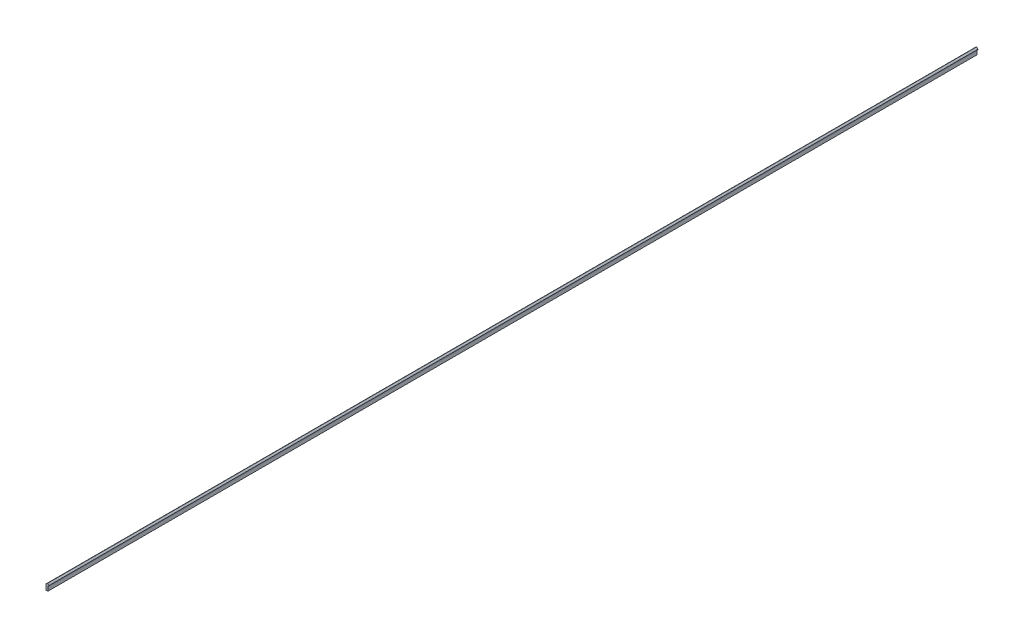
ISO-10303-21;
HEADER;
FILE_DESCRIPTION(('STEP AP214'),'2;1');
FILE_NAME('part.step','',(''),(''),'','','');
FILE_SCHEMA(('AUTOMOTIVE_DESIGN { 1 0 10303 214 1 1 1 1 }'));
ENDSEC;
DATA;
#1=APPLICATION_CONTEXT('core data for automotive mechanical design processes');
#2=APPLICATION_PROTOCOL_DEFINITION('international standard','automotive_design',2000,#1);
#3=PRODUCT_CONTEXT('',#1,'mechanical');
#4=PRODUCT('Part','Part','',(#3));
#5=PRODUCT_RELATED_PRODUCT_CATEGORY('part','',(#4));
#6=PRODUCT_DEFINITION_FORMATION('','',#4);
#7=PRODUCT_DEFINITION_CONTEXT('part definition',#1,'design');
#8=PRODUCT_DEFINITION('design','',#6,#7);
#9=PRODUCT_DEFINITION_SHAPE('','',#8);
#10=(LENGTH_UNIT() NAMED_UNIT(*) SI_UNIT(.MILLI.,.METRE.));
#11=(NAMED_UNIT(*) PLANE_ANGLE_UNIT() SI_UNIT($,.RADIAN.));
#12=(NAMED_UNIT(*) SI_UNIT($,.STERADIAN.) SOLID_ANGLE_UNIT());
#13=UNCERTAINTY_MEASURE_WITH_UNIT(LENGTH_MEASURE(1.E-05),#10,'distance_accuracy_value','');
#14=(GEOMETRIC_REPRESENTATION_CONTEXT(3) GLOBAL_UNCERTAINTY_ASSIGNED_CONTEXT((#13)) GLOBAL_UNIT_ASSIGNED_CONTEXT((#10,
#11,#12)) REPRESENTATION_CONTEXT('',''));
#15=CARTESIAN_POINT('',(0.,0.,0.));
#16=DIRECTION('',(0.,0.,1.));
#17=DIRECTION('',(1.,0.,0.));
#18=AXIS2_PLACEMENT_3D('',#15,#16,#17);
#19=CARTESIAN_POINT('',(0.,0.,2000.));
#20=DIRECTION('',(1.,0.,0.));
#21=DIRECTION('',(0.,1.,0.));
#22=AXIS2_PLACEMENT_3D('',#19,#20,#21);
#23=PLANE('',#22);
#24=DIRECTION('',(0.,-1.,0.));
#25=VECTOR('',#24,1.);
#26=CARTESIAN_POINT('',(0.,0.,0.));
#27=LINE('',#26,#25);
#28=CARTESIAN_POINT('',(0.,11.825,0.));
#29=VERTEX_POINT('',#28);
#30=CARTESIAN_POINT('',(0.,0.,0.));
#31=VERTEX_POINT('',#30);
#32=EDGE_CURVE('E121',#29,#31,#27,.T.);
#33=ORIENTED_EDGE('',*,*,#32,.T.);
#34=DIRECTION('',(0.,0.,-1.));
#35=VECTOR('',#34,1.);
#36=CARTESIAN_POINT('',(0.,0.,2000.));
#37=LINE('',#36,#35);
#38=CARTESIAN_POINT('',(0.,0.,2000.));
#39=VERTEX_POINT('',#38);
#40=EDGE_CURVE('E102',#39,#31,#37,.T.);
#41=ORIENTED_EDGE('',*,*,#40,.F.);
#42=DIRECTION('',(0.,-1.,0.));
#43=VECTOR('',#42,1.);
#44=CARTESIAN_POINT('',(0.,0.,2000.));
#45=LINE('',#44,#43);
#46=CARTESIAN_POINT('',(0.,11.825,2000.));
#47=VERTEX_POINT('',#46);
#48=EDGE_CURVE('E109',#47,#39,#45,.T.);
#49=ORIENTED_EDGE('',*,*,#48,.F.);
#50=DIRECTION('',(0.,0.,-1.));
#51=VECTOR('',#50,1.);
#52=CARTESIAN_POINT('',(0.,11.825,2000.));
#53=LINE('',#52,#51);
#54=EDGE_CURVE('E138',#47,#29,#53,.T.);
#55=ORIENTED_EDGE('',*,*,#54,.T.);
#56=EDGE_LOOP('',(#33,#41,#49,#55));
#57=FACE_BOUND('',#56,.T.);
#58=ADVANCED_FACE('F33',(#57),#23,.F.);
#59=CARTESIAN_POINT('',(3.99,0.,2000.));
#60=DIRECTION('',(0.,1.,0.));
#61=DIRECTION('',(-1.,0.,0.));
#62=AXIS2_PLACEMENT_3D('',#59,#60,#61);
#63=PLANE('',#62);
#64=DIRECTION('',(1.,0.,0.));
#65=VECTOR('',#64,1.);
#66=CARTESIAN_POINT('',(3.99,0.,0.));
#67=LINE('',#66,#65);
#68=CARTESIAN_POINT('',(3.99,0.,0.));
#69=VERTEX_POINT('',#68);
#70=EDGE_CURVE('E149',#31,#69,#67,.T.);
#71=ORIENTED_EDGE('',*,*,#70,.T.);
#72=DIRECTION('',(0.,0.,-1.));
#73=VECTOR('',#72,1.);
#74=CARTESIAN_POINT('',(3.99,0.,2000.));
#75=LINE('',#74,#73);
#76=CARTESIAN_POINT('',(3.99,0.,2000.));
#77=VERTEX_POINT('',#76);
#78=EDGE_CURVE('E105',#77,#69,#75,.T.);
#79=ORIENTED_EDGE('',*,*,#78,.F.);
#80=DIRECTION('',(1.,0.,0.));
#81=VECTOR('',#80,1.);
#82=CARTESIAN_POINT('',(3.99,0.,2000.));
#83=LINE('',#82,#81);
#84=EDGE_CURVE('E98',#39,#77,#83,.T.);
#85=ORIENTED_EDGE('',*,*,#84,.F.);
#86=ORIENTED_EDGE('',*,*,#40,.T.);
#87=EDGE_LOOP('',(#71,#79,#85,#86));
#88=FACE_BOUND('',#87,.T.);
#89=ADVANCED_FACE('F100',(#88),#63,.F.);
#90=CARTESIAN_POINT('',(3.99,10.3998363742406,2000.));
#91=DIRECTION('',(-1.,0.,0.));
#92=DIRECTION('',(0.,-1.,0.));
#93=AXIS2_PLACEMENT_3D('',#90,#91,#92);
#94=PLANE('',#93);
#95=DIRECTION('',(0.,1.,0.));
#96=VECTOR('',#95,1.);
#97=CARTESIAN_POINT('',(3.99,10.3998363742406,0.));
#98=LINE('',#97,#96);
#99=CARTESIAN_POINT('',(3.99,10.3998363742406,0.));
#100=VERTEX_POINT('',#99);
#101=EDGE_CURVE('E147',#69,#100,#98,.T.);
#102=ORIENTED_EDGE('',*,*,#101,.T.);
#103=DIRECTION('',(0.,0.,-1.));
#104=VECTOR('',#103,1.);
#105=CARTESIAN_POINT('',(3.99,10.3998363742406,2000.));
#106=LINE('',#105,#104);
#107=CARTESIAN_POINT('',(3.99,10.3998363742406,2000.));
#108=VERTEX_POINT('',#107);
#109=EDGE_CURVE('E126',#108,#100,#106,.T.);
#110=ORIENTED_EDGE('',*,*,#109,.F.);
#111=DIRECTION('',(0.,1.,0.));
#112=VECTOR('',#111,1.);
#113=CARTESIAN_POINT('',(3.99,10.3998363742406,2000.));
#114=LINE('',#113,#112);
#115=EDGE_CURVE('E108',#77,#108,#114,.T.);
#116=ORIENTED_EDGE('',*,*,#115,.F.);
#117=ORIENTED_EDGE('',*,*,#78,.T.);
#118=EDGE_LOOP('',(#102,#110,#116,#117));
#119=FACE_BOUND('',#118,.T.);
#120=ADVANCED_FACE('F163',(#119),#94,.F.);
#121=CARTESIAN_POINT('',(6.35,10.3998363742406,2000.));
#122=DIRECTION('',(0.,1.,0.));
#123=DIRECTION('',(0.,0.,1.));
#124=AXIS2_PLACEMENT_3D('',#121,#122,#123);
#125=PLANE('',#124);
#126=DIRECTION('',(1.,0.,0.));
#127=VECTOR('',#126,1.);
#128=CARTESIAN_POINT('',(6.35,10.3998363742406,0.));
#129=LINE('',#128,#127);
#130=CARTESIAN_POINT('',(6.35,10.3998363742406,0.));
#131=VERTEX_POINT('',#130);
#132=EDGE_CURVE('E145',#100,#131,#129,.T.);
#133=ORIENTED_EDGE('',*,*,#132,.T.);
#134=DIRECTION('',(0.,0.,-1.));
#135=VECTOR('',#134,1.);
#136=CARTESIAN_POINT('',(6.35,10.3998363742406,2000.));
#137=LINE('',#136,#135);
#138=CARTESIAN_POINT('',(6.35,10.3998363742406,2000.));
#139=VERTEX_POINT('',#138);
#140=EDGE_CURVE('E132',#139,#131,#137,.T.);
#141=ORIENTED_EDGE('',*,*,#140,.F.);
#142=DIRECTION('',(1.,0.,0.));
#143=VECTOR('',#142,1.);
#144=CARTESIAN_POINT('',(6.35,10.3998363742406,2000.));
#145=LINE('',#144,#143);
#146=EDGE_CURVE('E157',#108,#139,#145,.T.);
#147=ORIENTED_EDGE('',*,*,#146,.F.);
#148=ORIENTED_EDGE('',*,*,#109,.T.);
#149=EDGE_LOOP('',(#133,#141,#147,#148));
#150=FACE_BOUND('',#149,.T.);
#151=ADVANCED_FACE('F167',(#150),#125,.F.);
#152=CARTESIAN_POINT('',(6.35,11.825,2000.));
#153=DIRECTION('',(-1.,0.,0.));
#154=DIRECTION('',(0.,0.,1.));
#155=AXIS2_PLACEMENT_3D('',#152,#153,#154);
#156=PLANE('',#155);
#157=DIRECTION('',(0.,1.,0.));
#158=VECTOR('',#157,1.);
#159=CARTESIAN_POINT('',(6.35,11.825,0.));
#160=LINE('',#159,#158);
#161=CARTESIAN_POINT('',(6.35,11.825,0.));
#162=VERTEX_POINT('',#161);
#163=EDGE_CURVE('E143',#131,#162,#160,.T.);
#164=ORIENTED_EDGE('',*,*,#163,.T.);
#165=DIRECTION('',(0.,0.,-1.));
#166=VECTOR('',#165,1.);
#167=CARTESIAN_POINT('',(6.35,11.825,2000.));
#168=LINE('',#167,#166);
#169=CARTESIAN_POINT('',(6.35,11.825,2000.));
#170=VERTEX_POINT('',#169);
#171=EDGE_CURVE('E135',#170,#162,#168,.T.);
#172=ORIENTED_EDGE('',*,*,#171,.F.);
#173=DIRECTION('',(0.,1.,0.));
#174=VECTOR('',#173,1.);
#175=CARTESIAN_POINT('',(6.35,11.825,2000.));
#176=LINE('',#175,#174);
#177=EDGE_CURVE('E155',#139,#170,#176,.T.);
#178=ORIENTED_EDGE('',*,*,#177,.F.);
#179=ORIENTED_EDGE('',*,*,#140,.T.);
#180=EDGE_LOOP('',(#164,#172,#178,#179));
#181=FACE_BOUND('',#180,.T.);
#182=ADVANCED_FACE('F172',(#181),#156,.F.);
#183=CARTESIAN_POINT('',(3.175,15.,2000.));
#184=DIRECTION('',(-0.707106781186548,-0.707106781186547,0.));
#185=DIRECTION('',(0.707106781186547,-0.707106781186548,0.));
#186=AXIS2_PLACEMENT_3D('',#183,#184,#185);
#187=PLANE('',#186);
#188=DIRECTION('',(-0.707106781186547,0.707106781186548,0.));
#189=VECTOR('',#188,1.);
#190=CARTESIAN_POINT('',(3.175,15.,0.));
#191=LINE('',#190,#189);
#192=CARTESIAN_POINT('',(3.52855339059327,14.6464466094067,0.));
#193=VERTEX_POINT('',#192);
#194=EDGE_CURVE('E141',#162,#193,#191,.T.);
#195=ORIENTED_EDGE('',*,*,#194,.T.);
#196=DIRECTION('',(0.,0.,-1.));
#197=VECTOR('',#196,1.);
#198=CARTESIAN_POINT('',(3.52855339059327,14.6464466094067,2000.));
#199=LINE('',#198,#197);
#200=CARTESIAN_POINT('',(3.52855339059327,14.6464466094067,2000.));
#201=VERTEX_POINT('',#200);
#202=EDGE_CURVE('E41',#193,#201,#199,.F.);
#203=ORIENTED_EDGE('',*,*,#202,.T.);
#204=DIRECTION('',(-0.707106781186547,0.707106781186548,0.));
#205=VECTOR('',#204,1.);
#206=CARTESIAN_POINT('',(3.175,15.,2000.));
#207=LINE('',#206,#205);
#208=EDGE_CURVE('E153',#170,#201,#207,.T.);
#209=ORIENTED_EDGE('',*,*,#208,.F.);
#210=ORIENTED_EDGE('',*,*,#171,.T.);
#211=EDGE_LOOP('',(#195,#203,#209,#210));
#212=FACE_BOUND('',#211,.T.);
#213=ADVANCED_FACE('F179',(#212),#187,.F.);
#214=CARTESIAN_POINT('',(0.,11.825,2000.));
#215=DIRECTION('',(0.707106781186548,-0.707106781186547,0.));
#216=DIRECTION('',(0.707106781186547,0.707106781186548,0.));
#217=AXIS2_PLACEMENT_3D('',#214,#215,#216);
#218=PLANE('',#217);
#219=DIRECTION('',(-0.707106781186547,-0.707106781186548,0.));
#220=VECTOR('',#219,1.);
#221=CARTESIAN_POINT('',(0.,11.825,2000.));
#222=LINE('',#221,#220);
#223=CARTESIAN_POINT('',(2.82144660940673,14.6464466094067,2000.));
#224=VERTEX_POINT('',#223);
#225=EDGE_CURVE('E114',#224,#47,#222,.T.);
#226=ORIENTED_EDGE('',*,*,#225,.F.);
#227=DIRECTION('',(0.,0.,-1.));
#228=VECTOR('',#227,1.);
#229=CARTESIAN_POINT('',(2.82144660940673,14.6464466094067,2000.));
#230=LINE('',#229,#228);
#231=CARTESIAN_POINT('',(2.82144660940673,14.6464466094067,0.));
#232=VERTEX_POINT('',#231);
#233=EDGE_CURVE('E122',#224,#232,#230,.T.);
#234=ORIENTED_EDGE('',*,*,#233,.T.);
#235=DIRECTION('',(-0.707106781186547,-0.707106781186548,0.));
#236=VECTOR('',#235,1.);
#237=CARTESIAN_POINT('',(0.,11.825,0.));
#238=LINE('',#237,#236);
#239=EDGE_CURVE('E118',#232,#29,#238,.T.);
#240=ORIENTED_EDGE('',*,*,#239,.T.);
#241=ORIENTED_EDGE('',*,*,#54,.F.);
#242=EDGE_LOOP('',(#226,#234,#240,#241));
#243=FACE_BOUND('',#242,.T.);
#244=ADVANCED_FACE('F177',(#243),#218,.F.);
#245=CARTESIAN_POINT('',(0.,10.3998363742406,2000.));
#246=DIRECTION('',(0.,0.,1.));
#247=DIRECTION('',(1.,0.,0.));
#248=AXIS2_PLACEMENT_3D('',#245,#246,#247);
#249=PLANE('',#248);
#250=ORIENTED_EDGE('',*,*,#208,.T.);
#251=CARTESIAN_POINT('',(3.175,14.2928932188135,2000.));
#252=DIRECTION('',(0.,0.,1.));
#253=DIRECTION('',(1.,0.,0.));
#254=AXIS2_PLACEMENT_3D('',#251,#252,#253);
#255=CIRCLE('',#254,0.5);
#256=EDGE_CURVE('E11',#201,#224,#255,.T.);
#257=ORIENTED_EDGE('',*,*,#256,.T.);
#258=ORIENTED_EDGE('',*,*,#225,.T.);
#259=ORIENTED_EDGE('',*,*,#48,.T.);
#260=ORIENTED_EDGE('',*,*,#84,.T.);
#261=ORIENTED_EDGE('',*,*,#115,.T.);
#262=ORIENTED_EDGE('',*,*,#146,.T.);
#263=ORIENTED_EDGE('',*,*,#177,.T.);
#264=EDGE_LOOP('',(#250,#257,#258,#259,#260,#261,#262,#263));
#265=FACE_BOUND('',#264,.T.);
#266=ADVANCED_FACE('F112',(#265),#249,.T.);
#267=CARTESIAN_POINT('',(0.,10.3998363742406,0.));
#268=DIRECTION('',(0.,0.,1.));
#269=DIRECTION('',(1.,0.,0.));
#270=AXIS2_PLACEMENT_3D('',#267,#268,#269);
#271=PLANE('',#270);
#272=ORIENTED_EDGE('',*,*,#239,.F.);
#273=CARTESIAN_POINT('',(3.175,14.2928932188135,0.));
#274=DIRECTION('',(0.,0.,1.));
#275=DIRECTION('',(1.,0.,0.));
#276=AXIS2_PLACEMENT_3D('',#273,#274,#275);
#277=CIRCLE('',#276,0.5);
#278=EDGE_CURVE('E55',#232,#193,#277,.F.);
#279=ORIENTED_EDGE('',*,*,#278,.T.);
#280=ORIENTED_EDGE('',*,*,#194,.F.);
#281=ORIENTED_EDGE('',*,*,#163,.F.);
#282=ORIENTED_EDGE('',*,*,#132,.F.);
#283=ORIENTED_EDGE('',*,*,#101,.F.);
#284=ORIENTED_EDGE('',*,*,#70,.F.);
#285=ORIENTED_EDGE('',*,*,#32,.F.);
#286=EDGE_LOOP('',(#272,#279,#280,#281,#282,#283,#284,#285));
#287=FACE_BOUND('',#286,.T.);
#288=ADVANCED_FACE('F178',(#287),#271,.F.);
#289=CARTESIAN_POINT('',(3.175,14.2928932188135,2000.));
#290=DIRECTION('',(0.,0.,-1.));
#291=DIRECTION('',(-1.,0.,0.));
#292=AXIS2_PLACEMENT_3D('',#289,#290,#291);
#293=CYLINDRICAL_SURFACE('',#292,0.5);
#294=ORIENTED_EDGE('',*,*,#256,.F.);
#295=ORIENTED_EDGE('',*,*,#202,.F.);
#296=ORIENTED_EDGE('',*,*,#278,.F.);
#297=ORIENTED_EDGE('',*,*,#233,.F.);
#298=EDGE_LOOP('',(#294,#295,#296,#297));
#299=FACE_BOUND('',#298,.T.);
#300=ADVANCED_FACE('F35',(#299),#293,.T.);
#301=CLOSED_SHELL('',(#58,#89,#120,#151,#182,#213,#244,#266,#288,#300));
#302=MANIFOLD_SOLID_BREP('B2',#301);
#303=ADVANCED_BREP_SHAPE_REPRESENTATION('',(#18,#302),#14);
#304=SHAPE_DEFINITION_REPRESENTATION(#9,#303);
ENDSEC;
END-ISO-10303-21;
